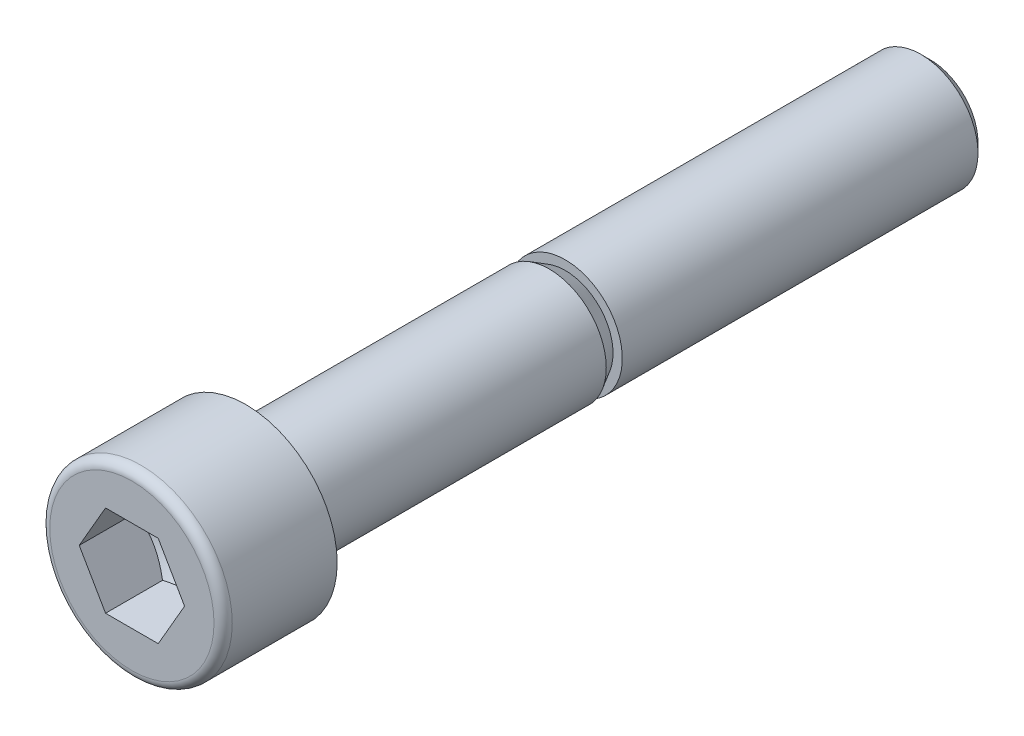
ISO-10303-21;
HEADER;
FILE_DESCRIPTION(('STEP AP214'),'2;1');
FILE_NAME('part.step','',(''),(''),'','','');
FILE_SCHEMA(('AUTOMOTIVE_DESIGN { 1 0 10303 214 1 1 1 1 }'));
ENDSEC;
DATA;
#1=APPLICATION_CONTEXT('core data for automotive mechanical design processes');
#2=APPLICATION_PROTOCOL_DEFINITION('international standard','automotive_design',2000,#1);
#3=PRODUCT_CONTEXT('',#1,'mechanical');
#4=PRODUCT('Part','Part','',(#3));
#5=PRODUCT_RELATED_PRODUCT_CATEGORY('part','',(#4));
#6=PRODUCT_DEFINITION_FORMATION('','',#4);
#7=PRODUCT_DEFINITION_CONTEXT('part definition',#1,'design');
#8=PRODUCT_DEFINITION('design','',#6,#7);
#9=PRODUCT_DEFINITION_SHAPE('','',#8);
#10=(LENGTH_UNIT() NAMED_UNIT(*) SI_UNIT(.MILLI.,.METRE.));
#11=(NAMED_UNIT(*) PLANE_ANGLE_UNIT() SI_UNIT($,.RADIAN.));
#12=(NAMED_UNIT(*) SI_UNIT($,.STERADIAN.) SOLID_ANGLE_UNIT());
#13=UNCERTAINTY_MEASURE_WITH_UNIT(LENGTH_MEASURE(1.E-05),#10,'distance_accuracy_value','');
#14=(GEOMETRIC_REPRESENTATION_CONTEXT(3) GLOBAL_UNCERTAINTY_ASSIGNED_CONTEXT((#13)) GLOBAL_UNIT_ASSIGNED_CONTEXT((#10,
#11,#12)) REPRESENTATION_CONTEXT('',''));
#15=CARTESIAN_POINT('',(0.,0.,0.));
#16=DIRECTION('',(0.,0.,1.));
#17=DIRECTION('',(1.,0.,0.));
#18=AXIS2_PLACEMENT_3D('',#15,#16,#17);
#19=CARTESIAN_POINT('',(0.,0.,5.01599999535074));
#20=DIRECTION('',(0.,0.,1.));
#21=DIRECTION('',(1.,0.,0.));
#22=AXIS2_PLACEMENT_3D('',#19,#20,#21);
#23=CONICAL_SURFACE('',#22,4.64651279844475,1.04719754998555);
#24=CARTESIAN_POINT('',(4.61880000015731,1.08177842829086E-09,5.00000000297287));
#25=CARTESIAN_POINT('',(4.51731585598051,0.175775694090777,4.94139112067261));
#26=CARTESIAN_POINT('',(4.41495570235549,0.35306868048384,4.88808940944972));
#27=CARTESIAN_POINT('',(4.2084630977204,0.710724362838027,4.79505287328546));
#28=CARTESIAN_POINT('',(4.10432697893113,0.891093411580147,4.7553509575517));
#29=CARTESIAN_POINT('',(3.89734524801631,1.24959628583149,4.69355206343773));
#30=CARTESIAN_POINT('',(3.79453147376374,1.42767496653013,4.67104373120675));
#31=CARTESIAN_POINT('',(3.58842040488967,1.78466980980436,4.64417850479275));
#32=CARTESIAN_POINT('',(3.48512385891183,1.96358467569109,4.63979935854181));
#33=CARTESIAN_POINT('',(3.29212534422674,2.2978679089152,4.64893274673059));
#34=CARTESIAN_POINT('',(3.20239441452,2.45328643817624,4.66020273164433));
#35=CARTESIAN_POINT('',(3.02351712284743,2.76311099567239,4.69591474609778));
#36=CARTESIAN_POINT('',(2.93437137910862,2.9175159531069,4.7203689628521));
#37=CARTESIAN_POINT('',(2.7551255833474,3.22797877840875,4.78149977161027));
#38=CARTESIAN_POINT('',(2.66504820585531,3.38399737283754,4.81843537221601));
#39=CARTESIAN_POINT('',(2.48623656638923,3.69370821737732,4.90226357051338));
#40=CARTESIAN_POINT('',(2.39750001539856,3.84740443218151,4.94913648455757));
#41=CARTESIAN_POINT('',(2.30940000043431,3.99999813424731,5.00000000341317));
#42=B_SPLINE_CURVE_WITH_KNOTS('',3,(#24,#25,#26,#27,#28,#29,#30,#31,#32,#33,#34,#35,#36,#37,#38,
#39,#40,#41),.UNSPECIFIED.,.F.,.F.,(4,2,2,2,2,2,2,2,4),(0.,0.634031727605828,1.26958704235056,
1.88941433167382,2.50848060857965,3.04741414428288,3.58684671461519,4.13824131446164,
4.68855375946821),.UNSPECIFIED.);
#43=CARTESIAN_POINT('',(4.61879999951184,0.,5.00000000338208));
#44=VERTEX_POINT('',#43);
#45=CARTESIAN_POINT('',(2.30939999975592,3.9999981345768,5.00000000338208));
#46=VERTEX_POINT('',#45);
#47=EDGE_CURVE('E118',#44,#46,#42,.T.);
#48=ORIENTED_EDGE('',*,*,#47,.T.);
#49=CARTESIAN_POINT('',(2.30939999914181,3.99999813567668,5.00000000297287));
#50=CARTESIAN_POINT('',(2.1198211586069,3.99999813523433,4.94526757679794));
#51=CARTESIAN_POINT('',(1.92874258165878,3.99999813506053,4.89515849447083));
#52=CARTESIAN_POINT('',(1.54348148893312,3.99999813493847,4.80659690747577));
#53=CARTESIAN_POINT('',(1.34929303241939,3.99999813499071,4.76817048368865));
#54=CARTESIAN_POINT('',(0.963095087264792,3.99999813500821,4.70637614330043));
#55=CARTESIAN_POINT('',(0.771139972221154,3.99999813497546,4.6826787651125));
#56=CARTESIAN_POINT('',(0.386122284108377,3.99999813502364,4.65086644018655));
#57=CARTESIAN_POINT('',(0.193061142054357,3.99999813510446,4.64273457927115));
#58=CARTESIAN_POINT('',(-0.193061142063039,3.99999813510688,4.64273457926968));
#59=CARTESIAN_POINT('',(-0.386122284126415,3.99999813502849,4.65086644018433));
#60=CARTESIAN_POINT('',(-0.771139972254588,3.9999981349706,4.68267876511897));
#61=CARTESIAN_POINT('',(-0.963095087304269,3.99999813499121,4.70637614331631));
#62=CARTESIAN_POINT('',(-1.34929303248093,3.99999813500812,4.76817048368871));
#63=CARTESIAN_POINT('',(-1.54348148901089,3.99999813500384,4.80659690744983));
#64=CARTESIAN_POINT('',(-1.92874258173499,3.9999981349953,4.89515849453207));
#65=CARTESIAN_POINT('',(-2.11982115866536,3.99999813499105,4.9452675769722));
#66=CARTESIAN_POINT('',(-2.30939999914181,3.99999813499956,5.00000000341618));
#67=B_SPLINE_CURVE_WITH_KNOTS('',3,(#49,#50,#51,#52,#53,#54,#55,#56,#57,#58,#59,#60,#61,#62,#63,
#64,#65,#66),.UNSPECIFIED.,.F.,.F.,(4,2,2,2,2,2,2,2,4),(0.,0.592146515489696,1.18560541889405,
1.76526089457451,2.34428613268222,2.92331137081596,3.50296684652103,4.09642574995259,
4.68857226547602),.UNSPECIFIED.);
#68=CARTESIAN_POINT('',(-2.30939999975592,3.9999981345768,5.00000000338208));
#69=VERTEX_POINT('',#68);
#70=EDGE_CURVE('E139',#46,#69,#67,.T.);
#71=ORIENTED_EDGE('',*,*,#70,.T.);
#72=CARTESIAN_POINT('',(-2.3094000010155,3.99999813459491,5.00000000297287));
#73=CARTESIAN_POINT('',(-2.41088414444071,3.82422244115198,4.94139112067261));
#74=CARTESIAN_POINT('',(-2.5132442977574,3.64692945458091,4.88808940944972));
#75=CARTESIAN_POINT('',(-2.71973690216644,3.2892737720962,4.79505287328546));
#76=CARTESIAN_POINT('',(-2.82387302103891,3.10890472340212,4.7553509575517));
#77=CARTESIAN_POINT('',(-3.0308547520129,2.75040184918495,4.69355206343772));
#78=CARTESIAN_POINT('',(-3.13366852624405,2.57232316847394,4.67104373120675));
#79=CARTESIAN_POINT('',(-3.33977959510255,2.21532832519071,4.64417850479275));
#80=CARTESIAN_POINT('',(-3.44307614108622,2.03641345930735,4.6397993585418));
#81=CARTESIAN_POINT('',(-3.63607465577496,1.70213022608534,4.64893274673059));
#82=CARTESIAN_POINT('',(-3.72580558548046,1.54671169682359,4.66020273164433));
#83=CARTESIAN_POINT('',(-3.90468287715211,1.23688713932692,4.69591474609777));
#84=CARTESIAN_POINT('',(-3.99382862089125,1.08248218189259,4.72036896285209));
#85=CARTESIAN_POINT('',(-4.17307441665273,0.772019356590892,4.78149977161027));
#86=CARTESIAN_POINT('',(-4.26315179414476,0.616000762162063,4.818435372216));
#87=CARTESIAN_POINT('',(-4.4419634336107,0.306289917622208,4.90226357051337));
#88=CARTESIAN_POINT('',(-4.53069998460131,0.15259370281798,4.94913648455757));
#89=CARTESIAN_POINT('',(-4.61879999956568,7.52252022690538E-10,5.00000000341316));
#90=B_SPLINE_CURVE_WITH_KNOTS('',3,(#72,#73,#74,#75,#76,#77,#78,#79,#80,#81,#82,#83,#84,#85,#86,
#87,#88,#89),.UNSPECIFIED.,.F.,.F.,(4,2,2,2,2,2,2,2,4),(0.,0.634031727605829,1.26958704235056,
1.88941433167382,2.50848060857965,3.04741414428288,3.58684671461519,4.13824131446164,
4.68855375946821),.UNSPECIFIED.);
#91=CARTESIAN_POINT('',(-4.61879999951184,0.,5.00000000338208));
#92=VERTEX_POINT('',#91);
#93=EDGE_CURVE('E146',#69,#92,#90,.T.);
#94=ORIENTED_EDGE('',*,*,#93,.T.);
#95=CARTESIAN_POINT('',(-4.6188000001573,-1.08177762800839E-09,5.00000000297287));
#96=CARTESIAN_POINT('',(-4.51731585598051,-0.175775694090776,4.94139112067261));
#97=CARTESIAN_POINT('',(-4.41495570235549,-0.353068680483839,4.88808940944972));
#98=CARTESIAN_POINT('',(-4.2084630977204,-0.710724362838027,4.79505287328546));
#99=CARTESIAN_POINT('',(-4.10432697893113,-0.891093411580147,4.7553509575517));
#100=CARTESIAN_POINT('',(-3.89734524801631,-1.24959628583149,4.69355206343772));
#101=CARTESIAN_POINT('',(-3.79453147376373,-1.42767496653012,4.67104373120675));
#102=CARTESIAN_POINT('',(-3.58842040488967,-1.78466980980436,4.64417850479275));
#103=CARTESIAN_POINT('',(-3.48512385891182,-1.96358467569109,4.6397993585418));
#104=CARTESIAN_POINT('',(-3.29212534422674,-2.2978679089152,4.64893274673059));
#105=CARTESIAN_POINT('',(-3.20239441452,-2.45328643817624,4.66020273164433));
#106=CARTESIAN_POINT('',(-3.02351712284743,-2.76311099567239,4.69591474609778));
#107=CARTESIAN_POINT('',(-2.93437137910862,-2.9175159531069,4.7203689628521));
#108=CARTESIAN_POINT('',(-2.7551255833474,-3.22797877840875,4.78149977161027));
#109=CARTESIAN_POINT('',(-2.66504820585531,-3.38399737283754,4.81843537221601));
#110=CARTESIAN_POINT('',(-2.48623656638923,-3.69370821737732,4.90226357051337));
#111=CARTESIAN_POINT('',(-2.39750001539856,-3.84740443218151,4.94913648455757));
#112=CARTESIAN_POINT('',(-2.30940000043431,-3.99999813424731,5.00000000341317));
#113=B_SPLINE_CURVE_WITH_KNOTS('',3,(#95,#96,#97,#98,#99,#100,#101,#102,#103,#104,#105,#106,
#107,#108,#109,#110,#111,#112),.UNSPECIFIED.,.F.,.F.,(4,2,2,2,2,2,2,2,4),(0.,0.634031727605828,
1.26958704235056,1.88941433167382,2.50848060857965,3.04741414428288,3.58684671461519,
4.13824131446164,4.68855375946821),.UNSPECIFIED.);
#114=CARTESIAN_POINT('',(-2.30939999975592,-3.9999981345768,5.00000000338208));
#115=VERTEX_POINT('',#114);
#116=EDGE_CURVE('E90',#92,#115,#113,.T.);
#117=ORIENTED_EDGE('',*,*,#116,.T.);
#118=CARTESIAN_POINT('',(-2.30939999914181,-3.99999813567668,5.00000000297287));
#119=CARTESIAN_POINT('',(-2.1198211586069,-3.99999813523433,4.94526757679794));
#120=CARTESIAN_POINT('',(-1.92874258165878,-3.99999813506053,4.89515849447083));
#121=CARTESIAN_POINT('',(-1.54348148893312,-3.99999813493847,4.80659690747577));
#122=CARTESIAN_POINT('',(-1.34929303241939,-3.99999813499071,4.76817048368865));
#123=CARTESIAN_POINT('',(-0.963095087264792,-3.99999813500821,4.70637614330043));
#124=CARTESIAN_POINT('',(-0.771139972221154,-3.99999813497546,4.6826787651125));
#125=CARTESIAN_POINT('',(-0.386122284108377,-3.99999813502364,4.65086644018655));
#126=CARTESIAN_POINT('',(-0.193061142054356,-3.99999813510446,4.64273457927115));
#127=CARTESIAN_POINT('',(0.19306114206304,-3.99999813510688,4.64273457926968));
#128=CARTESIAN_POINT('',(0.386122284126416,-3.99999813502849,4.65086644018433));
#129=CARTESIAN_POINT('',(0.77113997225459,-3.9999981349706,4.68267876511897));
#130=CARTESIAN_POINT('',(0.96309508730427,-3.99999813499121,4.70637614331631));
#131=CARTESIAN_POINT('',(1.34929303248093,-3.99999813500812,4.76817048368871));
#132=CARTESIAN_POINT('',(1.5434814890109,-3.99999813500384,4.80659690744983));
#133=CARTESIAN_POINT('',(1.92874258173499,-3.9999981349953,4.89515849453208));
#134=CARTESIAN_POINT('',(2.11982115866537,-3.99999813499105,4.9452675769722));
#135=CARTESIAN_POINT('',(2.30939999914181,-3.99999813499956,5.00000000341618));
#136=B_SPLINE_CURVE_WITH_KNOTS('',3,(#118,#119,#120,#121,#122,#123,#124,#125,#126,#127,#128,
#129,#130,#131,#132,#133,#134,#135),.UNSPECIFIED.,.F.,.F.,(4,2,2,2,2,2,2,2,4),(0.,
0.592146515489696,1.18560541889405,1.76526089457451,2.34428613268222,2.92331137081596,
3.50296684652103,4.09642574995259,4.68857226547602),.UNSPECIFIED.);
#137=CARTESIAN_POINT('',(2.30939999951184,-3.99999813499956,5.000000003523));
#138=VERTEX_POINT('',#137);
#139=EDGE_CURVE('E82',#115,#138,#136,.T.);
#140=ORIENTED_EDGE('',*,*,#139,.T.);
#141=CARTESIAN_POINT('',(2.3094000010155,-3.99999813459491,5.00000000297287));
#142=CARTESIAN_POINT('',(2.41088414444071,-3.82422244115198,4.94139112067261));
#143=CARTESIAN_POINT('',(2.5132442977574,-3.64692945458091,4.88808940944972));
#144=CARTESIAN_POINT('',(2.71973690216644,-3.2892737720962,4.79505287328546));
#145=CARTESIAN_POINT('',(2.82387302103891,-3.10890472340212,4.7553509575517));
#146=CARTESIAN_POINT('',(3.0308547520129,-2.75040184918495,4.69355206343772));
#147=CARTESIAN_POINT('',(3.13366852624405,-2.57232316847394,4.67104373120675));
#148=CARTESIAN_POINT('',(3.33977959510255,-2.21532832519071,4.64417850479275));
#149=CARTESIAN_POINT('',(3.44307614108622,-2.03641345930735,4.6397993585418));
#150=CARTESIAN_POINT('',(3.63607465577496,-1.70213022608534,4.64893274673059));
#151=CARTESIAN_POINT('',(3.72580558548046,-1.54671169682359,4.66020273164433));
#152=CARTESIAN_POINT('',(3.90468287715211,-1.23688713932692,4.69591474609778));
#153=CARTESIAN_POINT('',(3.99382862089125,-1.08248218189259,4.7203689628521));
#154=CARTESIAN_POINT('',(4.17307441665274,-0.772019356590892,4.78149977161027));
#155=CARTESIAN_POINT('',(4.26315179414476,-0.616000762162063,4.81843537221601));
#156=CARTESIAN_POINT('',(4.44196343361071,-0.306289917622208,4.90226357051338));
#157=CARTESIAN_POINT('',(4.53069998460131,-0.15259370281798,4.94913648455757));
#158=CARTESIAN_POINT('',(4.61879999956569,-7.52252443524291E-10,5.00000000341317));
#159=B_SPLINE_CURVE_WITH_KNOTS('',3,(#141,#142,#143,#144,#145,#146,#147,#148,#149,#150,#151,
#152,#153,#154,#155,#156,#157,#158),.UNSPECIFIED.,.F.,.F.,(4,2,2,2,2,2,2,2,4),(0.,
0.634031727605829,1.26958704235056,1.88941433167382,2.50848060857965,3.04741414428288,
3.58684671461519,4.13824131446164,4.68855375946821),.UNSPECIFIED.);
#160=EDGE_CURVE('E87',#138,#44,#159,.T.);
#161=ORIENTED_EDGE('',*,*,#160,.T.);
#162=EDGE_LOOP('',(#48,#71,#94,#117,#140,#161));
#163=FACE_BOUND('',#162,.T.);
#164=CARTESIAN_POINT('',(0.,0.,2.33333457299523));
#165=VERTEX_POINT('',#164);
#166=VERTEX_LOOP('',#165);
#167=FACE_BOUND('',#166,.T.);
#168=ADVANCED_FACE('F16',(#163,#167),#23,.F.);
#169=CARTESIAN_POINT('',(-2.3094,-3.99999813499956,10.));
#170=DIRECTION('',(0.,-1.,0.));
#171=DIRECTION('',(0.,0.,-1.));
#172=AXIS2_PLACEMENT_3D('',#169,#170,#171);
#173=PLANE('',#172);
#174=ORIENTED_EDGE('',*,*,#139,.F.);
#175=DIRECTION('',(0.,0.,1.));
#176=VECTOR('',#175,1.);
#177=CARTESIAN_POINT('',(-2.3094,-3.99999813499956,10.));
#178=LINE('',#177,#176);
#179=CARTESIAN_POINT('',(-2.3094,-3.99999813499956,10.));
#180=VERTEX_POINT('',#179);
#181=EDGE_CURVE('E93',#115,#180,#178,.T.);
#182=ORIENTED_EDGE('',*,*,#181,.T.);
#183=DIRECTION('',(1.,0.,0.));
#184=VECTOR('',#183,1.);
#185=CARTESIAN_POINT('',(0.,-3.99999813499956,10.));
#186=LINE('',#185,#184);
#187=CARTESIAN_POINT('',(2.3094,-3.99999813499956,10.));
#188=VERTEX_POINT('',#187);
#189=EDGE_CURVE('E99',#188,#180,#186,.F.);
#190=ORIENTED_EDGE('',*,*,#189,.F.);
#191=DIRECTION('',(0.,0.,1.));
#192=VECTOR('',#191,1.);
#193=CARTESIAN_POINT('',(2.3094,-3.99999813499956,10.));
#194=LINE('',#193,#192);
#195=EDGE_CURVE('E96',#188,#138,#194,.F.);
#196=ORIENTED_EDGE('',*,*,#195,.T.);
#197=EDGE_LOOP('',(#174,#182,#190,#196));
#198=FACE_BOUND('',#197,.T.);
#199=ADVANCED_FACE('F97',(#198),#173,.F.);
#200=CARTESIAN_POINT('',(-4.6188,0.,10.));
#201=DIRECTION('',(-0.866025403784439,-0.5,0.));
#202=DIRECTION('',(0.5,-0.866025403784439,0.));
#203=AXIS2_PLACEMENT_3D('',#200,#201,#202);
#204=PLANE('',#203);
#205=DIRECTION('',(0.,0.,1.));
#206=VECTOR('',#205,1.);
#207=CARTESIAN_POINT('',(-4.6188,0.,10.));
#208=LINE('',#207,#206);
#209=CARTESIAN_POINT('',(-4.6188,0.,10.));
#210=VERTEX_POINT('',#209);
#211=EDGE_CURVE('E154',#92,#210,#208,.T.);
#212=ORIENTED_EDGE('',*,*,#211,.T.);
#213=DIRECTION('',(-0.5,0.866025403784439,0.));
#214=VECTOR('',#213,1.);
#215=CARTESIAN_POINT('',(-2.3094,-3.99999813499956,10.));
#216=LINE('',#215,#214);
#217=EDGE_CURVE('E107',#180,#210,#216,.T.);
#218=ORIENTED_EDGE('',*,*,#217,.F.);
#219=ORIENTED_EDGE('',*,*,#181,.F.);
#220=ORIENTED_EDGE('',*,*,#116,.F.);
#221=EDGE_LOOP('',(#212,#218,#219,#220));
#222=FACE_BOUND('',#221,.T.);
#223=ADVANCED_FACE('F155',(#222),#204,.F.);
#224=CARTESIAN_POINT('',(-2.3094,3.99999813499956,10.));
#225=DIRECTION('',(-0.866025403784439,0.5,0.));
#226=DIRECTION('',(-0.5,-0.866025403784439,0.));
#227=AXIS2_PLACEMENT_3D('',#224,#225,#226);
#228=PLANE('',#227);
#229=DIRECTION('',(0.,0.,1.));
#230=VECTOR('',#229,1.);
#231=CARTESIAN_POINT('',(-2.3094,3.99999813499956,10.));
#232=LINE('',#231,#230);
#233=CARTESIAN_POINT('',(-2.3094,3.99999813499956,10.));
#234=VERTEX_POINT('',#233);
#235=EDGE_CURVE('E337',#69,#234,#232,.T.);
#236=ORIENTED_EDGE('',*,*,#235,.T.);
#237=DIRECTION('',(0.5,0.866025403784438,0.));
#238=VECTOR('',#237,1.);
#239=CARTESIAN_POINT('',(-4.6188,0.,10.));
#240=LINE('',#239,#238);
#241=EDGE_CURVE('E268',#210,#234,#240,.T.);
#242=ORIENTED_EDGE('',*,*,#241,.F.);
#243=ORIENTED_EDGE('',*,*,#211,.F.);
#244=ORIENTED_EDGE('',*,*,#93,.F.);
#245=EDGE_LOOP('',(#236,#242,#243,#244));
#246=FACE_BOUND('',#245,.T.);
#247=ADVANCED_FACE('F158',(#246),#228,.F.);
#248=CARTESIAN_POINT('',(2.3094,3.99999813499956,10.));
#249=DIRECTION('',(0.,1.,0.));
#250=DIRECTION('',(0.,0.,1.));
#251=AXIS2_PLACEMENT_3D('',#248,#249,#250);
#252=PLANE('',#251);
#253=ORIENTED_EDGE('',*,*,#70,.F.);
#254=DIRECTION('',(0.,0.,1.));
#255=VECTOR('',#254,1.);
#256=CARTESIAN_POINT('',(2.3094,3.99999813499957,10.));
#257=LINE('',#256,#255);
#258=CARTESIAN_POINT('',(2.3094,3.99999813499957,10.));
#259=VERTEX_POINT('',#258);
#260=EDGE_CURVE('E333',#46,#259,#257,.T.);
#261=ORIENTED_EDGE('',*,*,#260,.T.);
#262=DIRECTION('',(1.,0.,0.));
#263=VECTOR('',#262,1.);
#264=CARTESIAN_POINT('',(0.,3.99999813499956,10.));
#265=LINE('',#264,#263);
#266=EDGE_CURVE('E263',#234,#259,#265,.T.);
#267=ORIENTED_EDGE('',*,*,#266,.F.);
#268=ORIENTED_EDGE('',*,*,#235,.F.);
#269=EDGE_LOOP('',(#253,#261,#267,#268));
#270=FACE_BOUND('',#269,.T.);
#271=ADVANCED_FACE('F162',(#270),#252,.F.);
#272=CARTESIAN_POINT('',(4.6188,0.,10.));
#273=DIRECTION('',(0.866025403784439,0.5,0.));
#274=DIRECTION('',(-0.5,0.866025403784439,0.));
#275=AXIS2_PLACEMENT_3D('',#272,#273,#274);
#276=PLANE('',#275);
#277=DIRECTION('',(0.,0.,1.));
#278=VECTOR('',#277,1.);
#279=CARTESIAN_POINT('',(4.6188,0.,10.));
#280=LINE('',#279,#278);
#281=CARTESIAN_POINT('',(4.6188,0.,10.));
#282=VERTEX_POINT('',#281);
#283=EDGE_CURVE('E103',#44,#282,#280,.T.);
#284=ORIENTED_EDGE('',*,*,#283,.T.);
#285=DIRECTION('',(0.5,-0.866025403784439,0.));
#286=VECTOR('',#285,1.);
#287=CARTESIAN_POINT('',(2.3094,3.99999813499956,10.));
#288=LINE('',#287,#286);
#289=EDGE_CURVE('E258',#259,#282,#288,.T.);
#290=ORIENTED_EDGE('',*,*,#289,.F.);
#291=ORIENTED_EDGE('',*,*,#260,.F.);
#292=ORIENTED_EDGE('',*,*,#47,.F.);
#293=EDGE_LOOP('',(#284,#290,#291,#292));
#294=FACE_BOUND('',#293,.T.);
#295=ADVANCED_FACE('F166',(#294),#276,.F.);
#296=CARTESIAN_POINT('',(2.3094,-3.99999813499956,10.));
#297=DIRECTION('',(0.866025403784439,-0.5,0.));
#298=DIRECTION('',(0.5,0.866025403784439,0.));
#299=AXIS2_PLACEMENT_3D('',#296,#297,#298);
#300=PLANE('',#299);
#301=ORIENTED_EDGE('',*,*,#195,.F.);
#302=DIRECTION('',(-0.5,-0.866025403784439,0.));
#303=VECTOR('',#302,1.);
#304=CARTESIAN_POINT('',(4.6188,0.,10.));
#305=LINE('',#304,#303);
#306=EDGE_CURVE('E256',#282,#188,#305,.T.);
#307=ORIENTED_EDGE('',*,*,#306,.F.);
#308=ORIENTED_EDGE('',*,*,#283,.F.);
#309=ORIENTED_EDGE('',*,*,#160,.F.);
#310=EDGE_LOOP('',(#301,#307,#308,#309));
#311=FACE_BOUND('',#310,.T.);
#312=ADVANCED_FACE('F105',(#311),#300,.F.);
#313=CARTESIAN_POINT('',(0.,3.6,10.));
#314=DIRECTION('',(0.,0.,1.));
#315=DIRECTION('',(1.,0.,0.));
#316=AXIS2_PLACEMENT_3D('',#313,#314,#315);
#317=PLANE('',#316);
#318=ORIENTED_EDGE('',*,*,#289,.T.);
#319=ORIENTED_EDGE('',*,*,#306,.T.);
#320=ORIENTED_EDGE('',*,*,#189,.T.);
#321=ORIENTED_EDGE('',*,*,#217,.T.);
#322=ORIENTED_EDGE('',*,*,#241,.T.);
#323=ORIENTED_EDGE('',*,*,#266,.T.);
#324=EDGE_LOOP('',(#318,#319,#320,#321,#322,#323));
#325=FACE_BOUND('',#324,.T.);
#326=CARTESIAN_POINT('',(0.,0.,10.));
#327=DIRECTION('',(0.,0.,-1.));
#328=DIRECTION('',(-1.,0.,0.));
#329=AXIS2_PLACEMENT_3D('',#326,#327,#328);
#330=CIRCLE('',#329,7.2);
#331=CARTESIAN_POINT('',(-7.2,0.,10.));
#332=VERTEX_POINT('',#331);
#333=CARTESIAN_POINT('',(0.,7.2,10.));
#334=VERTEX_POINT('',#333);
#335=EDGE_CURVE('E245',#332,#334,#330,.T.);
#336=ORIENTED_EDGE('',*,*,#335,.F.);
#337=CARTESIAN_POINT('',(0.,0.,10.));
#338=DIRECTION('',(0.,0.,-1.));
#339=DIRECTION('',(1.,0.,0.));
#340=AXIS2_PLACEMENT_3D('',#337,#338,#339);
#341=CIRCLE('',#340,7.2);
#342=CARTESIAN_POINT('',(7.2,0.,10.));
#343=VERTEX_POINT('',#342);
#344=EDGE_CURVE('E37',#343,#332,#341,.T.);
#345=ORIENTED_EDGE('',*,*,#344,.F.);
#346=CARTESIAN_POINT('',(0.,0.,10.));
#347=DIRECTION('',(0.,0.,-1.));
#348=DIRECTION('',(0.,1.,0.));
#349=AXIS2_PLACEMENT_3D('',#346,#347,#348);
#350=CIRCLE('',#349,7.2);
#351=EDGE_CURVE('E234',#334,#343,#350,.T.);
#352=ORIENTED_EDGE('',*,*,#351,.F.);
#353=EDGE_LOOP('',(#336,#345,#352));
#354=FACE_BOUND('',#353,.T.);
#355=ADVANCED_FACE('F174',(#325,#354),#317,.T.);
#356=CARTESIAN_POINT('',(0.,0.,9.2));
#357=DIRECTION('',(0.,0.,-1.));
#358=DIRECTION('',(-1.,0.,0.));
#359=AXIS2_PLACEMENT_3D('',#356,#357,#358);
#360=TOROIDAL_SURFACE('',#359,7.2,0.8);
#361=ORIENTED_EDGE('',*,*,#344,.T.);
#362=ORIENTED_EDGE('',*,*,#335,.T.);
#363=ORIENTED_EDGE('',*,*,#351,.T.);
#364=EDGE_LOOP('',(#361,#362,#363));
#365=FACE_BOUND('',#364,.T.);
#366=CARTESIAN_POINT('',(0.,0.,9.2));
#367=DIRECTION('',(0.,0.,-1.));
#368=DIRECTION('',(-1.,0.,0.));
#369=AXIS2_PLACEMENT_3D('',#366,#367,#368);
#370=CIRCLE('',#369,8.);
#371=CARTESIAN_POINT('',(-8.,0.,9.2));
#372=VERTEX_POINT('',#371);
#373=EDGE_CURVE('E231',#372,#372,#370,.T.);
#374=ORIENTED_EDGE('',*,*,#373,.F.);
#375=EDGE_LOOP('',(#374));
#376=FACE_BOUND('',#375,.T.);
#377=ADVANCED_FACE('F208',(#365,#376),#360,.T.);
#378=CARTESIAN_POINT('',(0.,0.,4.6));
#379=DIRECTION('',(0.,0.,-1.));
#380=DIRECTION('',(-1.,0.,0.));
#381=AXIS2_PLACEMENT_3D('',#378,#379,#380);
#382=CYLINDRICAL_SURFACE('',#381,8.);
#383=CARTESIAN_POINT('',(0.,0.,0.));
#384=DIRECTION('',(0.,0.,-1.));
#385=DIRECTION('',(-1.,0.,0.));
#386=AXIS2_PLACEMENT_3D('',#383,#384,#385);
#387=CIRCLE('',#386,8.);
#388=CARTESIAN_POINT('',(-8.,0.,0.));
#389=VERTEX_POINT('',#388);
#390=EDGE_CURVE('E116',#389,#389,#387,.T.);
#391=ORIENTED_EDGE('',*,*,#390,.F.);
#392=EDGE_LOOP('',(#391));
#393=FACE_BOUND('',#392,.T.);
#394=ORIENTED_EDGE('',*,*,#373,.T.);
#395=EDGE_LOOP('',(#394));
#396=FACE_BOUND('',#395,.T.);
#397=ADVANCED_FACE('F205',(#393,#396),#382,.T.);
#398=CARTESIAN_POINT('',(0.,6.75,0.));
#399=DIRECTION('',(0.,0.,-1.));
#400=DIRECTION('',(-1.,0.,0.));
#401=AXIS2_PLACEMENT_3D('',#398,#399,#400);
#402=PLANE('',#401);
#403=CARTESIAN_POINT('',(0.,0.,0.));
#404=DIRECTION('',(0.,0.,-1.));
#405=DIRECTION('',(-1.,0.,0.));
#406=AXIS2_PLACEMENT_3D('',#403,#404,#405);
#407=CIRCLE('',#406,5.5);
#408=CARTESIAN_POINT('',(-5.5,0.,0.));
#409=VERTEX_POINT('',#408);
#410=EDGE_CURVE('E230',#409,#409,#407,.T.);
#411=ORIENTED_EDGE('',*,*,#410,.F.);
#412=EDGE_LOOP('',(#411));
#413=FACE_BOUND('',#412,.T.);
#414=ORIENTED_EDGE('',*,*,#390,.T.);
#415=EDGE_LOOP('',(#414));
#416=FACE_BOUND('',#415,.T.);
#417=ADVANCED_FACE('F202',(#413,#416),#402,.T.);
#418=CARTESIAN_POINT('',(0.,0.,-0.500000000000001));
#419=DIRECTION('',(0.,0.,-1.));
#420=DIRECTION('',(-1.,0.,0.));
#421=AXIS2_PLACEMENT_3D('',#418,#419,#420);
#422=TOROIDAL_SURFACE('',#421,5.5,0.5);
#423=CARTESIAN_POINT('',(0.,0.,-0.5));
#424=DIRECTION('',(0.,0.,-1.));
#425=DIRECTION('',(-1.,0.,0.));
#426=AXIS2_PLACEMENT_3D('',#423,#424,#425);
#427=CIRCLE('',#426,5.);
#428=CARTESIAN_POINT('',(-5.,0.,-0.500000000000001));
#429=VERTEX_POINT('',#428);
#430=EDGE_CURVE('E227',#429,#429,#427,.T.);
#431=ORIENTED_EDGE('',*,*,#430,.F.);
#432=EDGE_LOOP('',(#431));
#433=FACE_BOUND('',#432,.T.);
#434=ORIENTED_EDGE('',*,*,#410,.T.);
#435=EDGE_LOOP('',(#434));
#436=FACE_BOUND('',#435,.T.);
#437=ADVANCED_FACE('F18',(#433,#436),#422,.F.);
#438=CARTESIAN_POINT('',(0.,0.,-13.5468956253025));
#439=DIRECTION('',(0.,0.,-1.));
#440=DIRECTION('',(-1.,0.,0.));
#441=AXIS2_PLACEMENT_3D('',#438,#439,#440);
#442=CYLINDRICAL_SURFACE('',#441,5.);
#443=CARTESIAN_POINT('',(0.,0.,-26.5937912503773));
#444=DIRECTION('',(0.,0.,1.));
#445=DIRECTION('',(0.,1.,0.));
#446=AXIS2_PLACEMENT_3D('',#443,#444,#445);
#447=CIRCLE('',#446,4.99999999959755);
#448=CARTESIAN_POINT('',(0.,4.99999999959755,-26.5937912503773));
#449=VERTEX_POINT('',#448);
#450=EDGE_CURVE('E223',#449,#449,#447,.F.);
#451=ORIENTED_EDGE('',*,*,#450,.F.);
#452=EDGE_LOOP('',(#451));
#453=FACE_BOUND('',#452,.T.);
#454=ORIENTED_EDGE('',*,*,#430,.T.);
#455=EDGE_LOOP('',(#454));
#456=FACE_BOUND('',#455,.T.);
#457=ADVANCED_FACE('F197',(#453,#456),#442,.T.);
#458=CARTESIAN_POINT('',(0.,0.,-26.5937912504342));
#459=DIRECTION('',(0.,0.,1.));
#460=DIRECTION('',(1.,0.,0.));
#461=AXIS2_PLACEMENT_3D('',#458,#459,#460);
#462=CONICAL_SURFACE('',#461,4.99999999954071,0.523598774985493);
#463=CARTESIAN_POINT('',(0.,0.,-28.0000000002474));
#464=DIRECTION('',(0.,0.,1.));
#465=DIRECTION('',(1.,0.,0.));
#466=AXIS2_PLACEMENT_3D('',#463,#464,#465);
#467=CIRCLE('',#466,4.18812500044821);
#468=CARTESIAN_POINT('',(4.18812500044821,0.,-28.0000000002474));
#469=VERTEX_POINT('',#468);
#470=EDGE_CURVE('E226',#469,#469,#467,.F.);
#471=ORIENTED_EDGE('',*,*,#470,.F.);
#472=EDGE_LOOP('',(#471));
#473=FACE_BOUND('',#472,.T.);
#474=ORIENTED_EDGE('',*,*,#450,.T.);
#475=EDGE_LOOP('',(#474));
#476=FACE_BOUND('',#475,.T.);
#477=ADVANCED_FACE('F193',(#473,#476),#462,.T.);
#478=CARTESIAN_POINT('',(0.,2.0940625,-60.));
#479=DIRECTION('',(0.,0.,-1.));
#480=DIRECTION('',(-1.,0.,0.));
#481=AXIS2_PLACEMENT_3D('',#478,#479,#480);
#482=PLANE('',#481);
#483=CARTESIAN_POINT('',(0.,0.,-60.0000000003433));
#484=DIRECTION('',(0.,0.,1.));
#485=DIRECTION('',(1.,0.,0.));
#486=AXIS2_PLACEMENT_3D('',#483,#484,#485);
#487=CIRCLE('',#486,4.18812500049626);
#488=CARTESIAN_POINT('',(4.18812500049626,0.,-60.0000000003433));
#489=VERTEX_POINT('',#488);
#490=EDGE_CURVE('E280',#489,#489,#487,.T.);
#491=ORIENTED_EDGE('',*,*,#490,.F.);
#492=EDGE_LOOP('',(#491));
#493=FACE_BOUND('',#492,.T.);
#494=ADVANCED_FACE('F189',(#493),#482,.T.);
#495=CARTESIAN_POINT('',(0.,4.5940625,-28.));
#496=DIRECTION('',(0.,0.,1.));
#497=DIRECTION('',(1.,0.,0.));
#498=AXIS2_PLACEMENT_3D('',#495,#496,#497);
#499=PLANE('',#498);
#500=ORIENTED_EDGE('',*,*,#470,.T.);
#501=EDGE_LOOP('',(#500));
#502=FACE_BOUND('',#501,.T.);
#503=CARTESIAN_POINT('',(0.,0.,-28.));
#504=DIRECTION('',(0.,0.,-1.));
#505=DIRECTION('',(-1.,0.,0.));
#506=AXIS2_PLACEMENT_3D('',#503,#504,#505);
#507=CIRCLE('',#506,5.);
#508=CARTESIAN_POINT('',(-5.,0.,-28.));
#509=VERTEX_POINT('',#508);
#510=EDGE_CURVE('E28',#509,#509,#507,.T.);
#511=ORIENTED_EDGE('',*,*,#510,.F.);
#512=EDGE_LOOP('',(#511));
#513=FACE_BOUND('',#512,.T.);
#514=ADVANCED_FACE('F181',(#502,#513),#499,.T.);
#515=CARTESIAN_POINT('',(0.,0.,-59.1881249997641));
#516=DIRECTION('',(0.,0.,1.));
#517=DIRECTION('',(1.,0.,0.));
#518=AXIS2_PLACEMENT_3D('',#515,#516,#517);
#519=CONICAL_SURFACE('',#518,4.99999999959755,0.785398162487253);
#520=ORIENTED_EDGE('',*,*,#490,.T.);
#521=EDGE_LOOP('',(#520));
#522=FACE_BOUND('',#521,.T.);
#523=CARTESIAN_POINT('',(0.,0.,-59.188125));
#524=DIRECTION('',(0.,0.,-1.));
#525=DIRECTION('',(-1.,0.,0.));
#526=AXIS2_PLACEMENT_3D('',#523,#524,#525);
#527=CIRCLE('',#526,5.);
#528=CARTESIAN_POINT('',(-5.,0.,-59.188125));
#529=VERTEX_POINT('',#528);
#530=EDGE_CURVE('E10',#529,#529,#527,.F.);
#531=ORIENTED_EDGE('',*,*,#530,.F.);
#532=EDGE_LOOP('',(#531));
#533=FACE_BOUND('',#532,.T.);
#534=ADVANCED_FACE('F177',(#522,#533),#519,.T.);
#535=CARTESIAN_POINT('',(0.,0.,-43.5940625));
#536=DIRECTION('',(0.,0.,-1.));
#537=DIRECTION('',(-1.,0.,0.));
#538=AXIS2_PLACEMENT_3D('',#535,#536,#537);
#539=CYLINDRICAL_SURFACE('',#538,5.);
#540=ORIENTED_EDGE('',*,*,#510,.T.);
#541=EDGE_LOOP('',(#540));
#542=FACE_BOUND('',#541,.T.);
#543=ORIENTED_EDGE('',*,*,#530,.T.);
#544=EDGE_LOOP('',(#543));
#545=FACE_BOUND('',#544,.T.);
#546=ADVANCED_FACE('F175',(#542,#545),#539,.T.);
#547=CLOSED_SHELL('',(#168,#199,#223,#247,#271,#295,#312,#355,#377,#397,#417,#437,#457,#477,
#494,#514,#534,#546));
#548=MANIFOLD_SOLID_BREP('B1',#547);
#549=ADVANCED_BREP_SHAPE_REPRESENTATION('',(#18,#548),#14);
#550=SHAPE_DEFINITION_REPRESENTATION(#9,#549);
ENDSEC;
END-ISO-10303-21;
